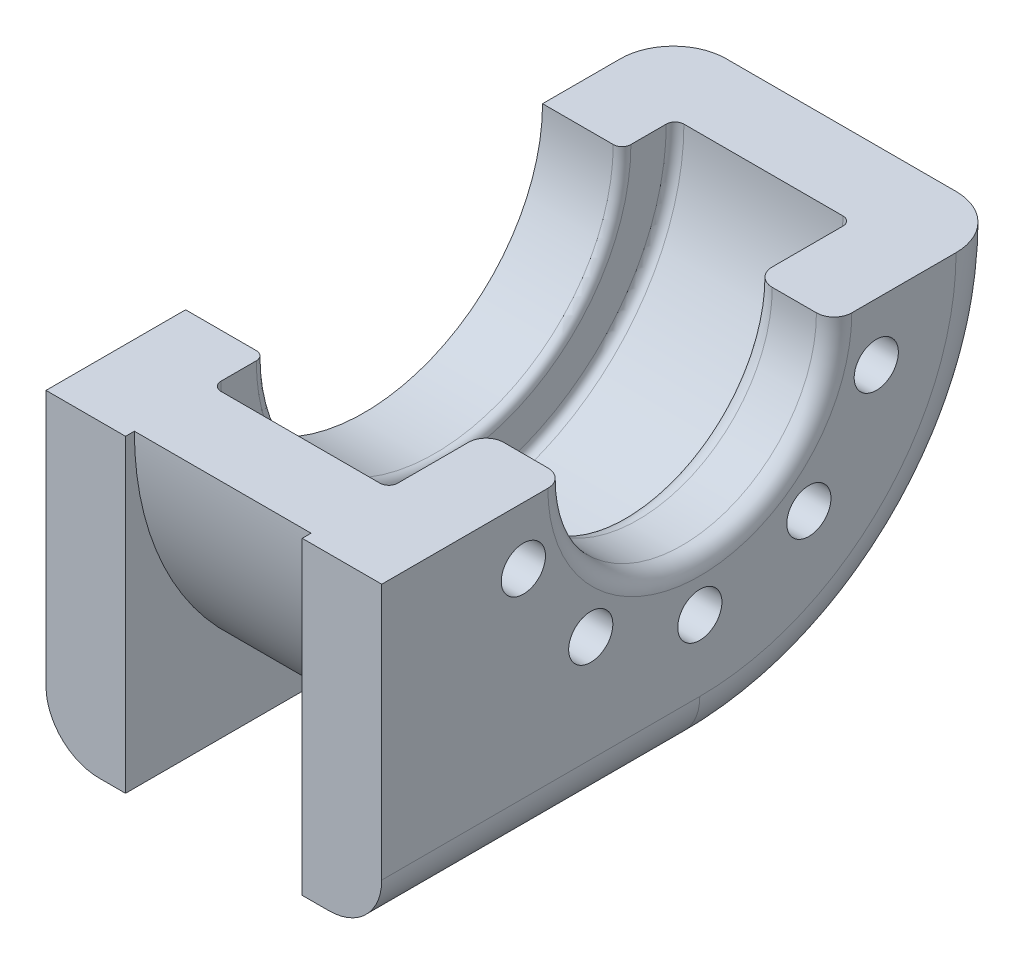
from build123d import *

# Parameters (mm, degrees)
ESTRUSIONE_ESTRUSIONE2_DEPTH = 190
SCHIZZO3_R                   = 76
TAGLIO_ESTRUSIONE1_DEPTH     = 315.841229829
SCHIZZO4_R                   = 101
TAGLIO_ESTRUSIONE2_DEPTH     = 45
SCHIZZO5_R                   = 131
TAGLIO_ESTRUSIONE3_DEPTH     = 100
TAGLIO_ESTRUSIONE4_DEPTH     = 315.841229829
RACCORDO1_R                  = 5
RIPETIZIONECIRCOLARE1_COUNT  = 10
RACCORDO3_R                  = 30
RACCORDO4_R                  = 10
RACCORDO5_R                  = 5
TAGLIO_ESTRUSIONE5_DEPTH     = 100
RACCORDO6_R                  = 10


with BuildPart() as part:
    # Schizzo1 → Estrusione-Estrusione2 (new body)
    with BuildSketch(Plane(origin=(0, 0, 0), x_dir=(0, 0, -1), z_dir=(1, 0, 0))):
        with BuildLine():
            Line((-180, 174.999729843), (-180, -175))
            Line((-180, -175), (0, -175))
            ThreePointArc((0, -175), (175, 0), (0, 175))
            Line((0, 175), (-180, 174.999729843))
        make_face()
    extrude(amount=-ESTRUSIONE_ESTRUSIONE2_DEPTH)

    # Schizzo3 → Taglio-Estrusione1 (cut, through all)
    with BuildSketch(Plane(origin=(0, 0, 0), x_dir=(0, 0, -1), z_dir=(1, 0, 0))):
        Circle(SCHIZZO3_R)
    extrude(amount=-TAGLIO_ESTRUSIONE1_DEPTH, mode=Mode.SUBTRACT)

    # Schizzo4 → Taglio-Estrusione2 (cut)
    with BuildSketch(Plane.ZY.offset(190)):
        Circle(SCHIZZO4_R)
    extrude(amount=-TAGLIO_ESTRUSIONE2_DEPTH, mode=Mode.SUBTRACT)

    # Schizzo5 → Taglio-Estrusione3 (cut)
    with BuildSketch(Plane.ZY.offset(145)):
        Circle(SCHIZZO5_R)
    extrude(amount=-TAGLIO_ESTRUSIONE3_DEPTH, mode=Mode.SUBTRACT)

    # Schizzo8 → 25.0mm Dowel Hole1 (revolve, cut)
    with BuildSketch(Plane(origin=(0, -32.446784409, 99.860934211), x_dir=(0, 0, -1), z_dir=(0, 1, 0))):
        Polygon((0, 0), (0, 52.510757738), (12.5, 45), (12.5, 0), align=None)
    f_25_0mm_dowel_hole1 = revolve(axis=Axis((6.35, -32.446784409, 99.860934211), (-1, 0, 0)), mode=Mode.SUBTRACT)

    # Schizzo10 → Taglio-Estrusione4 (cut, through all)
    with BuildSketch(Plane(origin=(0, 0, 0), x_dir=(0, 0, -1), z_dir=(1, 0, 0))):
        Polygon((175, 0), (-180, -0.000135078), (-180, 174.999729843), (175, 174.999729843), align=None)
    extrude(amount=-TAGLIO_ESTRUSIONE4_DEPTH, mode=Mode.SUBTRACT)


with BuildPart() as taglio_estrusione4_kept_piece:
    # of the separate pieces the step leaves, the one the design keeps (taglio_estrusione4_pieces_kept)
    add(part.part.solids().sort_by_distance((0, -0.000135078, 180))[0])

    # Raccordo1
    raccordo1_edges = [taglio_estrusione4_kept_piece.edges().sort_by_distance(p)[0] for p in [
        (-145, -101, -3.8431e-05),
    ]]
    fillet(raccordo1_edges, radius=RACCORDO1_R)

    # RipetizioneCircolare1: 25.0mm Dowel Hole1 ×10 about axis, 5 skipped
    ripetizionecircolare1_axis = Axis((0, 0, 0), (1, 0, 0))
    add([f_25_0mm_dowel_hole1.rotate(ripetizionecircolare1_axis, i * 360 / RIPETIZIONECIRCOLARE1_COUNT) for i in range(1, RIPETIZIONECIRCOLARE1_COUNT) if i not in (5, 6, 7, 8, 9)], mode=Mode.SUBTRACT)

    # Raccordo3
    raccordo3_edges = [taglio_estrusione4_kept_piece.edges().sort_by_distance(p)[0] for p in [
        (-190, -123.743686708, -123.743686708),
        (0, -175, 90),
        (0, -123.743686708, -123.743686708),
        (-190, -175, 90),
    ]]
    fillet(raccordo3_edges, radius=RACCORDO3_R)

    # Raccordo4
    raccordo4_edges = [taglio_estrusione4_kept_piece.edges().sort_by_distance(p)[0] for p in [
        (-45, -76, -2.8918e-05),
    ]]
    fillet(raccordo4_edges, radius=RACCORDO4_R)

    # Raccordo5
    raccordo5_edges = [taglio_estrusione4_kept_piece.edges().sort_by_distance(p)[0] for p in [
        (-45, -131, -4.9846e-05),
        (-145, -131, -4.9846e-05),
    ]]
    fillet(raccordo5_edges, radius=RACCORDO5_R)

    # Schizzo24 → Taglio-Estrusione5 (cut)
    with BuildSketch(Plane(origin=(-145, 0, 0), x_dir=(0, 0, -1), z_dir=(1, 0, 0))):
        with BuildLine():
            Line((-180, -0.000135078), (-175, -0.000133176))
            ThreePointArc((-175, -0.000133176), (-123.743639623, -123.743733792), (0, -175))
            Line((0, -175), (-180, -175))
            Line((-180, -175), (-180, -145))
            Line((-180, -145), (-180, -0.000135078))
        make_face()
    extrude(amount=TAGLIO_ESTRUSIONE5_DEPTH, mode=Mode.SUBTRACT)

    # Raccordo6
    raccordo6_edges = [taglio_estrusione4_kept_piece.edges().sort_by_distance(p)[0] for p in [
        (0, -76, -2.8918e-05),
    ]]
    fillet(raccordo6_edges, radius=RACCORDO6_R)


solid = taglio_estrusione4_kept_piece.part
